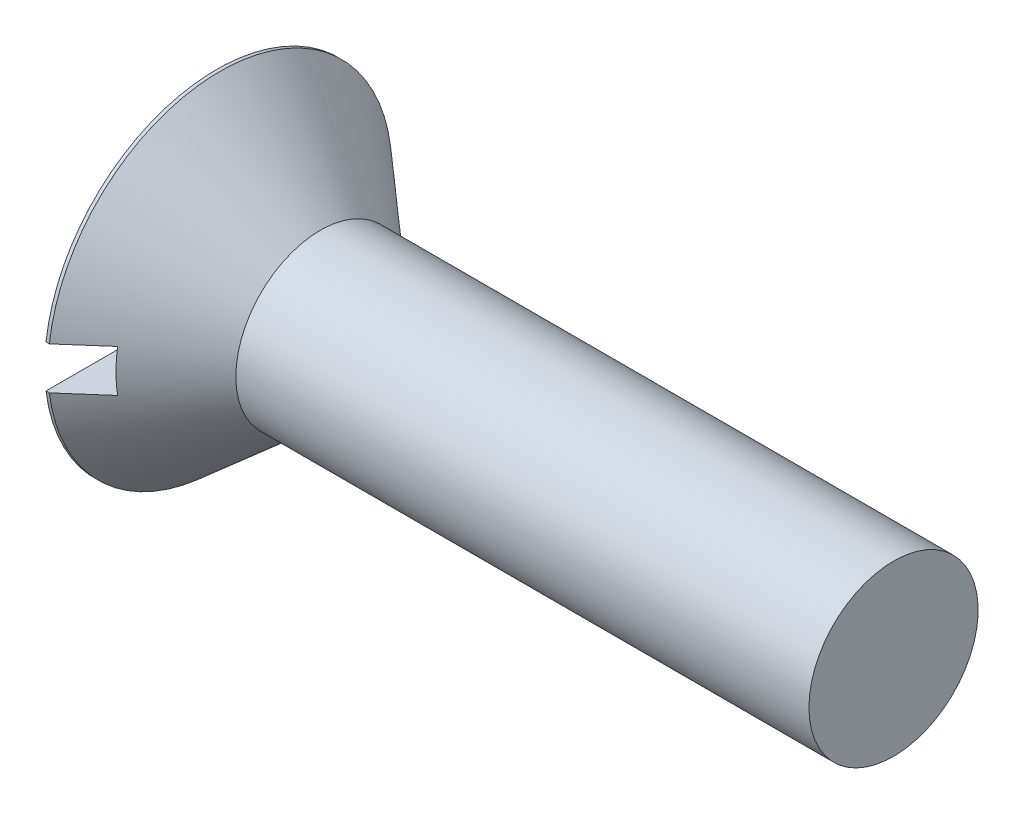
ISO-10303-21;
HEADER;
FILE_DESCRIPTION(('STEP AP214'),'2;1');
FILE_NAME('part.step','',(''),(''),'','','');
FILE_SCHEMA(('AUTOMOTIVE_DESIGN { 1 0 10303 214 1 1 1 1 }'));
ENDSEC;
DATA;
#1=APPLICATION_CONTEXT('core data for automotive mechanical design processes');
#2=APPLICATION_PROTOCOL_DEFINITION('international standard','automotive_design',2000,#1);
#3=PRODUCT_CONTEXT('',#1,'mechanical');
#4=PRODUCT('Part','Part','',(#3));
#5=PRODUCT_RELATED_PRODUCT_CATEGORY('part','',(#4));
#6=PRODUCT_DEFINITION_FORMATION('','',#4);
#7=PRODUCT_DEFINITION_CONTEXT('part definition',#1,'design');
#8=PRODUCT_DEFINITION('design','',#6,#7);
#9=PRODUCT_DEFINITION_SHAPE('','',#8);
#10=(LENGTH_UNIT() NAMED_UNIT(*) SI_UNIT(.MILLI.,.METRE.));
#11=(NAMED_UNIT(*) PLANE_ANGLE_UNIT() SI_UNIT($,.RADIAN.));
#12=(NAMED_UNIT(*) SI_UNIT($,.STERADIAN.) SOLID_ANGLE_UNIT());
#13=UNCERTAINTY_MEASURE_WITH_UNIT(LENGTH_MEASURE(1.E-05),#10,'distance_accuracy_value','');
#14=(GEOMETRIC_REPRESENTATION_CONTEXT(3) GLOBAL_UNCERTAINTY_ASSIGNED_CONTEXT((#13)) GLOBAL_UNIT_ASSIGNED_CONTEXT((#10,
#11,#12)) REPRESENTATION_CONTEXT('',''));
#15=CARTESIAN_POINT('',(0.,0.,0.));
#16=DIRECTION('',(0.,0.,1.));
#17=DIRECTION('',(1.,0.,0.));
#18=AXIS2_PLACEMENT_3D('',#15,#16,#17);
#19=CARTESIAN_POINT('',(2.2352,1.1938,-9.67739999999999));
#20=DIRECTION('',(-1.,0.,0.));
#21=DIRECTION('',(0.,0.,1.));
#22=AXIS2_PLACEMENT_3D('',#19,#20,#21);
#23=PLANE('',#22);
#24=DIRECTION('',(0.,-1.,0.));
#25=VECTOR('',#24,1.);
#26=CARTESIAN_POINT('',(2.2352,1.19379999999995,4.93366687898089));
#27=LINE('',#26,#25);
#28=CARTESIAN_POINT('',(2.2352,0.93915286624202,4.93366687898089));
#29=VERTEX_POINT('',#28);
#30=CARTESIAN_POINT('',(2.2352,-0.939152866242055,4.93366687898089));
#31=VERTEX_POINT('',#30);
#32=EDGE_CURVE('E317',#29,#31,#27,.T.);
#33=ORIENTED_EDGE('',*,*,#32,.T.);
#34=DIRECTION('',(0.,0.,-1.));
#35=VECTOR('',#34,1.);
#36=CARTESIAN_POINT('',(2.2352,-0.939152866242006,-9.6774));
#37=LINE('',#36,#35);
#38=CARTESIAN_POINT('',(2.2352,-0.939152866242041,0.939152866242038));
#39=VERTEX_POINT('',#38);
#40=EDGE_CURVE('E164',#31,#39,#37,.T.);
#41=ORIENTED_EDGE('',*,*,#40,.T.);
#42=DIRECTION('',(0.,-1.,0.));
#43=VECTOR('',#42,1.);
#44=CARTESIAN_POINT('',(2.2352,1.1938,0.939152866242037));
#45=LINE('',#44,#43);
#46=CARTESIAN_POINT('',(2.2352,-1.1938,0.939152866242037));
#47=VERTEX_POINT('',#46);
#48=EDGE_CURVE('E41',#39,#47,#45,.T.);
#49=ORIENTED_EDGE('',*,*,#48,.T.);
#50=DIRECTION('',(0.,0.,1.));
#51=VECTOR('',#50,1.);
#52=CARTESIAN_POINT('',(2.2352,-1.1938,-9.6774));
#53=LINE('',#52,#51);
#54=CARTESIAN_POINT('',(2.2352,-1.1938,7.80709754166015));
#55=VERTEX_POINT('',#54);
#56=EDGE_CURVE('E56',#47,#55,#53,.T.);
#57=ORIENTED_EDGE('',*,*,#56,.T.);
#58=CARTESIAN_POINT('',(2.2352,0.,0.));
#59=DIRECTION('',(-1.,0.,0.));
#60=DIRECTION('',(0.,0.,1.));
#61=AXIS2_PLACEMENT_3D('',#58,#59,#60);
#62=CIRCLE('',#61,7.89784340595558);
#63=CARTESIAN_POINT('',(2.2352,1.1938,7.80709754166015));
#64=VERTEX_POINT('',#63);
#65=EDGE_CURVE('E265',#64,#55,#62,.F.);
#66=ORIENTED_EDGE('',*,*,#65,.F.);
#67=DIRECTION('',(0.,0.,-1.));
#68=VECTOR('',#67,1.);
#69=CARTESIAN_POINT('',(2.2352,1.1938,9.6774));
#70=LINE('',#69,#68);
#71=CARTESIAN_POINT('',(2.2352,1.1938,0.939152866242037));
#72=VERTEX_POINT('',#71);
#73=EDGE_CURVE('E229',#64,#72,#70,.T.);
#74=ORIENTED_EDGE('',*,*,#73,.T.);
#75=CARTESIAN_POINT('',(2.2352,0.939152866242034,0.939152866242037));
#76=VERTEX_POINT('',#75);
#77=EDGE_CURVE('E11',#72,#76,#45,.T.);
#78=ORIENTED_EDGE('',*,*,#77,.T.);
#79=DIRECTION('',(0.,0.,1.));
#80=VECTOR('',#79,1.);
#81=CARTESIAN_POINT('',(2.2352,0.939152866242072,-9.67739999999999));
#82=LINE('',#81,#80);
#83=EDGE_CURVE('E318',#76,#29,#82,.T.);
#84=ORIENTED_EDGE('',*,*,#83,.T.);
#85=EDGE_LOOP('',(#33,#41,#49,#57,#66,#74,#78,#84));
#86=FACE_BOUND('',#85,.T.);
#87=ADVANCED_FACE('F33',(#86),#23,.T.);
#88=DIRECTION('',(0.,1.,0.));
#89=VECTOR('',#88,1.);
#90=CARTESIAN_POINT('',(2.2352,1.1938,-0.939152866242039));
#91=LINE('',#90,#89);
#92=CARTESIAN_POINT('',(2.2352,-1.1938,-0.939152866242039));
#93=VERTEX_POINT('',#92);
#94=CARTESIAN_POINT('',(2.2352,-0.939152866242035,-0.939152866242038));
#95=VERTEX_POINT('',#94);
#96=EDGE_CURVE('E390',#93,#95,#91,.T.);
#97=ORIENTED_EDGE('',*,*,#96,.T.);
#98=DIRECTION('',(0.,0.,-1.));
#99=VECTOR('',#98,1.);
#100=CARTESIAN_POINT('',(2.2352,-0.939152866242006,-9.6774));
#101=LINE('',#100,#99);
#102=CARTESIAN_POINT('',(2.2352,-0.939152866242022,-4.9336668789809));
#103=VERTEX_POINT('',#102);
#104=EDGE_CURVE('E190',#95,#103,#101,.T.);
#105=ORIENTED_EDGE('',*,*,#104,.T.);
#106=DIRECTION('',(0.,1.,0.));
#107=VECTOR('',#106,1.);
#108=CARTESIAN_POINT('',(2.2352,1.19379999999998,-4.93366687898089));
#109=LINE('',#108,#107);
#110=CARTESIAN_POINT('',(2.2352,0.939152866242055,-4.93366687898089));
#111=VERTEX_POINT('',#110);
#112=EDGE_CURVE('E333',#103,#111,#109,.T.);
#113=ORIENTED_EDGE('',*,*,#112,.T.);
#114=DIRECTION('',(0.,0.,1.));
#115=VECTOR('',#114,1.);
#116=CARTESIAN_POINT('',(2.2352,0.939152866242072,-9.67739999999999));
#117=LINE('',#116,#115);
#118=CARTESIAN_POINT('',(2.2352,0.939152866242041,-0.939152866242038));
#119=VERTEX_POINT('',#118);
#120=EDGE_CURVE('E323',#111,#119,#117,.T.);
#121=ORIENTED_EDGE('',*,*,#120,.T.);
#122=CARTESIAN_POINT('',(2.2352,1.1938,-0.939152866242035));
#123=VERTEX_POINT('',#122);
#124=EDGE_CURVE('E48',#119,#123,#91,.T.);
#125=ORIENTED_EDGE('',*,*,#124,.T.);
#126=CARTESIAN_POINT('',(2.2352,1.1938,-7.80709754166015));
#127=VERTEX_POINT('',#126);
#128=EDGE_CURVE('E232',#123,#127,#70,.T.);
#129=ORIENTED_EDGE('',*,*,#128,.T.);
#130=CARTESIAN_POINT('',(2.2352,-1.1938,-7.80709754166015));
#131=VERTEX_POINT('',#130);
#132=EDGE_CURVE('E269',#131,#127,#62,.F.);
#133=ORIENTED_EDGE('',*,*,#132,.F.);
#134=EDGE_CURVE('E233',#131,#93,#53,.T.);
#135=ORIENTED_EDGE('',*,*,#134,.T.);
#136=EDGE_LOOP('',(#97,#105,#113,#121,#125,#129,#133,#135));
#137=FACE_BOUND('',#136,.T.);
#138=ADVANCED_FACE('F312',(#137),#23,.T.);
#139=CARTESIAN_POINT('',(8.69008083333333,0.,0.497178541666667));
#140=DIRECTION('',(-0.0683113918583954,0.,-0.997664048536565));
#141=DIRECTION('',(-0.997664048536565,0.,0.0683113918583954));
#142=AXIS2_PLACEMENT_3D('',#139,#140,#141);
#143=PLANE('',#142);
#144=ORIENTED_EDGE('',*,*,#48,.F.);
#145=DIRECTION('',(0.995344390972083,0.0681525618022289,-0.0681525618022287));
#146=VECTOR('',#145,1.);
#147=CARTESIAN_POINT('',(8.72380707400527,-0.494869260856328,0.494869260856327));
#148=LINE('',#147,#146);
#149=CARTESIAN_POINT('',(7.9756,-0.546100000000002,0.546099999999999));
#150=VERTEX_POINT('',#149);
#151=EDGE_CURVE('E162',#39,#150,#148,.T.);
#152=ORIENTED_EDGE('',*,*,#151,.T.);
#153=DIRECTION('',(0.793328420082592,0.606365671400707,-0.0543202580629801));
#154=VECTOR('',#153,1.);
#155=CARTESIAN_POINT('',(0.,-6.6421,1.0922));
#156=LINE('',#155,#154);
#157=CARTESIAN_POINT('',(0.,-6.6421,1.0922));
#158=VERTEX_POINT('',#157);
#159=EDGE_CURVE('E187',#158,#150,#156,.T.);
#160=ORIENTED_EDGE('',*,*,#159,.F.);
#161=DIRECTION('',(0.,-1.,0.));
#162=VECTOR('',#161,1.);
#163=CARTESIAN_POINT('',(0.,6.6421,1.0922));
#164=LINE('',#163,#162);
#165=CARTESIAN_POINT('',(0.,-1.1938,1.0922));
#166=VERTEX_POINT('',#165);
#167=EDGE_CURVE('E345',#166,#158,#164,.T.);
#168=ORIENTED_EDGE('',*,*,#167,.F.);
#169=DIRECTION('',(0.997664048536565,0.,-0.0683113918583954));
#170=VECTOR('',#169,1.);
#171=CARTESIAN_POINT('',(2.95873739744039,-1.1938,0.889611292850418));
#172=LINE('',#171,#170);
#173=EDGE_CURVE('E224',#166,#47,#172,.T.);
#174=ORIENTED_EDGE('',*,*,#173,.T.);
#175=EDGE_LOOP('',(#144,#152,#160,#168,#174));
#176=FACE_BOUND('',#175,.T.);
#177=ADVANCED_FACE('F185',(#176),#143,.T.);
#178=DIRECTION('',(0.793328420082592,-0.606365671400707,-0.05432025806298));
#179=VECTOR('',#178,1.);
#180=CARTESIAN_POINT('',(0.,6.6421,1.0922));
#181=LINE('',#180,#179);
#182=CARTESIAN_POINT('',(0.,6.6421,1.0922));
#183=VERTEX_POINT('',#182);
#184=CARTESIAN_POINT('',(7.9756,0.546100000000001,0.5461));
#185=VERTEX_POINT('',#184);
#186=EDGE_CURVE('E210',#183,#185,#181,.T.);
#187=ORIENTED_EDGE('',*,*,#186,.T.);
#188=DIRECTION('',(-0.995344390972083,0.0681525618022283,0.0681525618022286));
#189=VECTOR('',#188,1.);
#190=CARTESIAN_POINT('',(8.72380707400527,0.494869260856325,0.494869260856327));
#191=LINE('',#190,#189);
#192=EDGE_CURVE('E329',#185,#76,#191,.T.);
#193=ORIENTED_EDGE('',*,*,#192,.T.);
#194=ORIENTED_EDGE('',*,*,#77,.F.);
#195=DIRECTION('',(-0.997664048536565,0.,0.0683113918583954));
#196=VECTOR('',#195,1.);
#197=CARTESIAN_POINT('',(1.63967255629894,1.1938,0.979929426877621));
#198=LINE('',#197,#196);
#199=CARTESIAN_POINT('',(0.,1.1938,1.0922));
#200=VERTEX_POINT('',#199);
#201=EDGE_CURVE('E226',#72,#200,#198,.T.);
#202=ORIENTED_EDGE('',*,*,#201,.T.);
#203=EDGE_CURVE('E346',#183,#200,#164,.T.);
#204=ORIENTED_EDGE('',*,*,#203,.F.);
#205=EDGE_LOOP('',(#187,#193,#194,#202,#204));
#206=FACE_BOUND('',#205,.T.);
#207=ADVANCED_FACE('F366',(#206),#143,.T.);
#208=CARTESIAN_POINT('',(8.69008083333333,0.,-0.497178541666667));
#209=DIRECTION('',(-0.0683113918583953,0.,0.997664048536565));
#210=DIRECTION('',(0.997664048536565,0.,0.0683113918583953));
#211=AXIS2_PLACEMENT_3D('',#208,#209,#210);
#212=PLANE('',#211);
#213=DIRECTION('',(0.793328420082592,0.606365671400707,0.0543202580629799));
#214=VECTOR('',#213,1.);
#215=CARTESIAN_POINT('',(0.,-6.6421,-1.0922));
#216=LINE('',#215,#214);
#217=CARTESIAN_POINT('',(0.,-6.6421,-1.0922));
#218=VERTEX_POINT('',#217);
#219=CARTESIAN_POINT('',(7.9756,-0.5461,-0.5461));
#220=VERTEX_POINT('',#219);
#221=EDGE_CURVE('E205',#218,#220,#216,.T.);
#222=ORIENTED_EDGE('',*,*,#221,.T.);
#223=DIRECTION('',(-0.995344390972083,-0.0681525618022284,-0.0681525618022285));
#224=VECTOR('',#223,1.);
#225=CARTESIAN_POINT('',(8.72380707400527,-0.494869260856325,-0.494869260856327));
#226=LINE('',#225,#224);
#227=EDGE_CURVE('E336',#220,#95,#226,.T.);
#228=ORIENTED_EDGE('',*,*,#227,.T.);
#229=ORIENTED_EDGE('',*,*,#96,.F.);
#230=DIRECTION('',(-0.997664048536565,0.,-0.0683113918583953));
#231=VECTOR('',#230,1.);
#232=CARTESIAN_POINT('',(1.63967255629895,-1.1938,-0.979929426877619));
#233=LINE('',#232,#231);
#234=CARTESIAN_POINT('',(0.,-1.1938,-1.0922));
#235=VERTEX_POINT('',#234);
#236=EDGE_CURVE('E220',#93,#235,#233,.T.);
#237=ORIENTED_EDGE('',*,*,#236,.T.);
#238=DIRECTION('',(0.,1.,0.));
#239=VECTOR('',#238,1.);
#240=CARTESIAN_POINT('',(0.,-6.6421,-1.0922));
#241=LINE('',#240,#239);
#242=EDGE_CURVE('E208',#218,#235,#241,.T.);
#243=ORIENTED_EDGE('',*,*,#242,.F.);
#244=EDGE_LOOP('',(#222,#228,#229,#237,#243));
#245=FACE_BOUND('',#244,.T.);
#246=ADVANCED_FACE('F389',(#245),#212,.T.);
#247=ORIENTED_EDGE('',*,*,#124,.F.);
#248=DIRECTION('',(0.995344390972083,-0.0681525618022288,0.0681525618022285));
#249=VECTOR('',#248,1.);
#250=CARTESIAN_POINT('',(8.72380707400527,0.494869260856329,-0.494869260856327));
#251=LINE('',#250,#249);
#252=CARTESIAN_POINT('',(7.9756,0.546100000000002,-0.546099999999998));
#253=VERTEX_POINT('',#252);
#254=EDGE_CURVE('E319',#119,#253,#251,.T.);
#255=ORIENTED_EDGE('',*,*,#254,.T.);
#256=DIRECTION('',(0.793328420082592,-0.606365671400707,0.0543202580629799));
#257=VECTOR('',#256,1.);
#258=CARTESIAN_POINT('',(0.,6.6421,-1.0922));
#259=LINE('',#258,#257);
#260=CARTESIAN_POINT('',(0.,6.6421,-1.0922));
#261=VERTEX_POINT('',#260);
#262=EDGE_CURVE('E199',#261,#253,#259,.T.);
#263=ORIENTED_EDGE('',*,*,#262,.F.);
#264=CARTESIAN_POINT('',(0.,1.1938,-1.0922));
#265=VERTEX_POINT('',#264);
#266=EDGE_CURVE('E204',#265,#261,#241,.T.);
#267=ORIENTED_EDGE('',*,*,#266,.F.);
#268=DIRECTION('',(0.997664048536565,0.,0.0683113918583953));
#269=VECTOR('',#268,1.);
#270=CARTESIAN_POINT('',(2.95873739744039,1.1938,-0.88961129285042));
#271=LINE('',#270,#269);
#272=EDGE_CURVE('E222',#265,#123,#271,.T.);
#273=ORIENTED_EDGE('',*,*,#272,.T.);
#274=EDGE_LOOP('',(#247,#255,#263,#267,#273));
#275=FACE_BOUND('',#274,.T.);
#276=ADVANCED_FACE('F376',(#275),#212,.T.);
#277=CARTESIAN_POINT('',(0.,0.,0.));
#278=DIRECTION('',(-1.,0.,0.));
#279=DIRECTION('',(0.,0.,1.));
#280=AXIS2_PLACEMENT_3D('',#277,#278,#279);
#281=PLANE('',#280);
#282=DIRECTION('',(0.,0.,1.));
#283=VECTOR('',#282,1.);
#284=CARTESIAN_POINT('',(0.,6.6421,-1.0922));
#285=LINE('',#284,#283);
#286=EDGE_CURVE('E342',#261,#183,#285,.T.);
#287=ORIENTED_EDGE('',*,*,#286,.T.);
#288=ORIENTED_EDGE('',*,*,#203,.T.);
#289=DIRECTION('',(0.,0.,-1.));
#290=VECTOR('',#289,1.);
#291=CARTESIAN_POINT('',(0.,1.1938,9.6774));
#292=LINE('',#291,#290);
#293=CARTESIAN_POINT('',(0.,1.1938,9.60348438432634));
#294=VERTEX_POINT('',#293);
#295=EDGE_CURVE('E237',#294,#200,#292,.T.);
#296=ORIENTED_EDGE('',*,*,#295,.F.);
#297=CARTESIAN_POINT('',(0.,0.,0.));
#298=DIRECTION('',(-1.,0.,0.));
#299=DIRECTION('',(0.,0.,1.));
#300=AXIS2_PLACEMENT_3D('',#297,#298,#299);
#301=CIRCLE('',#300,9.6774);
#302=CARTESIAN_POINT('',(0.,1.1938,-9.60348438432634));
#303=VERTEX_POINT('',#302);
#304=EDGE_CURVE('E264',#294,#303,#301,.T.);
#305=ORIENTED_EDGE('',*,*,#304,.T.);
#306=EDGE_CURVE('E228',#265,#303,#292,.T.);
#307=ORIENTED_EDGE('',*,*,#306,.F.);
#308=ORIENTED_EDGE('',*,*,#266,.T.);
#309=EDGE_LOOP('',(#287,#288,#296,#305,#307,#308));
#310=FACE_BOUND('',#309,.T.);
#311=ADVANCED_FACE('F35',(#310),#281,.T.);
#312=DIRECTION('',(0.,0.,1.));
#313=VECTOR('',#312,1.);
#314=CARTESIAN_POINT('',(0.,-1.1938,-9.6774));
#315=LINE('',#314,#313);
#316=CARTESIAN_POINT('',(0.,-1.1938,9.60348438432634));
#317=VERTEX_POINT('',#316);
#318=EDGE_CURVE('E240',#166,#317,#315,.T.);
#319=ORIENTED_EDGE('',*,*,#318,.F.);
#320=ORIENTED_EDGE('',*,*,#167,.T.);
#321=DIRECTION('',(0.,0.,-1.));
#322=VECTOR('',#321,1.);
#323=CARTESIAN_POINT('',(0.,-6.6421,1.0922));
#324=LINE('',#323,#322);
#325=EDGE_CURVE('E203',#158,#218,#324,.T.);
#326=ORIENTED_EDGE('',*,*,#325,.T.);
#327=ORIENTED_EDGE('',*,*,#242,.T.);
#328=CARTESIAN_POINT('',(0.,-1.1938,-9.60348438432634));
#329=VERTEX_POINT('',#328);
#330=EDGE_CURVE('E241',#329,#235,#315,.T.);
#331=ORIENTED_EDGE('',*,*,#330,.F.);
#332=EDGE_CURVE('E261',#329,#317,#301,.T.);
#333=ORIENTED_EDGE('',*,*,#332,.T.);
#334=EDGE_LOOP('',(#319,#320,#326,#327,#331,#333));
#335=FACE_BOUND('',#334,.T.);
#336=ADVANCED_FACE('F297',(#335),#281,.T.);
#337=CARTESIAN_POINT('',(2.2352,1.1938,9.6774));
#338=DIRECTION('',(0.,1.,0.));
#339=DIRECTION('',(0.,0.,1.));
#340=AXIS2_PLACEMENT_3D('',#337,#338,#339);
#341=PLANE('',#340);
#342=ORIENTED_EDGE('',*,*,#201,.F.);
#343=ORIENTED_EDGE('',*,*,#73,.F.);
#344=CARTESIAN_POINT('',(-11.4898026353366,1.1938,-19.7928369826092));
#345=CARTESIAN_POINT('',(-10.7282739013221,1.1938,-19.1296381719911));
#346=CARTESIAN_POINT('',(-9.96679664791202,1.1938,-18.4663802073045));
#347=CARTESIAN_POINT('',(-8.44400448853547,1.1938,-17.1396696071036));
#348=CARTESIAN_POINT('',(-7.68268958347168,1.1938,-16.4762169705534));
#349=CARTESIAN_POINT('',(-6.16009107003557,1.1938,-15.1488746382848));
#350=CARTESIAN_POINT('',(-5.3988075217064,1.1938,-14.4849848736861));
#351=CARTESIAN_POINT('',(-3.87658787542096,1.1938,-13.156815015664));
#352=CARTESIAN_POINT('',(-3.11565177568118,1.1938,-12.4925349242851));
#353=CARTESIAN_POINT('',(-1.61266837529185,1.1938,-11.1793728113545));
#354=CARTESIAN_POINT('',(-0.870608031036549,1.1938,-10.5305057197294));
#355=CARTESIAN_POINT('',(0.612654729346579,1.1938,-9.23176820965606));
#356=CARTESIAN_POINT('',(1.35385713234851,1.1938,-8.5818977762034));
#357=CARTESIAN_POINT('',(2.46431349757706,1.1938,-7.6057063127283));
#358=CARTESIAN_POINT('',(2.83420463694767,1.1938,-7.28011039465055));
#359=CARTESIAN_POINT('',(3.5733462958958,1.1938,-6.62818839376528));
#360=CARTESIAN_POINT('',(3.9425968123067,1.1938,-6.30186230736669));
#361=CARTESIAN_POINT('',(4.68009898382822,1.1938,-5.64810195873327));
#362=CARTESIAN_POINT('',(5.04835066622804,1.1938,-5.32066772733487));
#363=CARTESIAN_POINT('',(5.59944958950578,1.1938,-4.82808839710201));
#364=CARTESIAN_POINT('',(5.78293538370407,1.1938,-4.66365796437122));
#365=CARTESIAN_POINT('',(6.14932062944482,1.1938,-4.334145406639));
#366=CARTESIAN_POINT('',(6.33222008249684,1.1938,-4.16906328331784));
#367=CARTESIAN_POINT('',(6.61085838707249,1.1938,-3.91630624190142));
#368=CARTESIAN_POINT('',(6.7068950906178,1.1938,-3.82895981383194));
#369=CARTESIAN_POINT('',(6.89868546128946,1.1938,-3.65395652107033));
#370=CARTESIAN_POINT('',(6.99443912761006,1.1938,-3.56629965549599));
#371=CARTESIAN_POINT('',(7.28123634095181,1.1938,-3.30272759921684));
#372=CARTESIAN_POINT('',(7.47176893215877,1.1938,-3.12625362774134));
#373=CARTESIAN_POINT('',(7.75652836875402,1.1938,-2.85918720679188));
#374=CARTESIAN_POINT('',(7.85158225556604,1.1938,-2.76947695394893));
#375=CARTESIAN_POINT('',(8.04094270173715,1.1938,-2.58927165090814));
#376=CARTESIAN_POINT('',(8.13524926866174,1.1938,-2.4987766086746));
#377=CARTESIAN_POINT('',(8.32280199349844,1.1938,-2.31680042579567));
#378=CARTESIAN_POINT('',(8.41604873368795,1.1938,-2.22531988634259));
#379=CARTESIAN_POINT('',(8.60113460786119,1.1938,-2.04094854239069));
#380=CARTESIAN_POINT('',(8.6929738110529,1.1938,-1.94805780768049));
#381=CARTESIAN_POINT('',(8.87422797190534,1.1938,-1.76066399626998));
#382=CARTESIAN_POINT('',(8.96365125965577,1.1938,-1.66616899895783));
#383=CARTESIAN_POINT('',(9.13952454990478,1.1938,-1.47414431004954));
#384=CARTESIAN_POINT('',(9.22596985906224,1.1938,-1.37661025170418));
#385=CARTESIAN_POINT('',(9.35151816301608,1.1938,-1.22717825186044));
#386=CARTESIAN_POINT('',(9.39260236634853,1.1938,-1.17695004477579));
#387=CARTESIAN_POINT('',(9.47299969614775,1.1938,-1.07510106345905));
#388=CARTESIAN_POINT('',(9.5123131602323,1.1938,-1.02348055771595));
#389=CARTESIAN_POINT('',(9.58844644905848,1.1938,-0.918595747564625));
#390=CARTESIAN_POINT('',(9.62527166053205,1.1938,-0.865335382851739));
#391=CARTESIAN_POINT('',(9.69553557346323,1.1938,-0.756643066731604));
#392=CARTESIAN_POINT('',(9.72897683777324,1.1938,-0.70121280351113));
#393=CARTESIAN_POINT('',(9.78229490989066,1.1938,-0.60363465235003));
#394=CARTESIAN_POINT('',(9.80334267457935,1.1938,-0.562131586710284));
#395=CARTESIAN_POINT('',(9.84217202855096,1.1938,-0.477589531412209));
#396=CARTESIAN_POINT('',(9.85995294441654,1.1938,-0.434550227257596));
#397=CARTESIAN_POINT('',(9.89116809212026,1.1938,-0.347314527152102));
#398=CARTESIAN_POINT('',(9.90463847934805,1.1938,-0.303131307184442));
#399=CARTESIAN_POINT('',(9.92643385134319,1.1938,-0.213513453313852));
#400=CARTESIAN_POINT('',(9.93476333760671,1.1938,-0.168079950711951));
#401=CARTESIAN_POINT('',(9.94391422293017,1.1938,-0.0900477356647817));
#402=CARTESIAN_POINT('',(9.94622642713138,1.1938,-0.0576208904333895));
#403=CARTESIAN_POINT('',(9.94780330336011,1.1938,0.00730866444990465));
#404=CARTESIAN_POINT('',(9.94706765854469,1.1938,0.0398113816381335));
#405=CARTESIAN_POINT('',(9.94028733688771,1.1938,0.137101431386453));
#406=CARTESIAN_POINT('',(9.92966101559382,1.1938,0.201600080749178));
#407=CARTESIAN_POINT('',(9.89262661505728,1.1938,0.350494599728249));
#408=CARTESIAN_POINT('',(9.86193906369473,1.1938,0.433774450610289));
#409=CARTESIAN_POINT('',(9.80699388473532,1.1938,0.554532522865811));
#410=CARTESIAN_POINT('',(9.78712669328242,1.1938,0.594194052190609));
#411=CARTESIAN_POINT('',(9.74504611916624,1.1938,0.672252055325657));
#412=CARTESIAN_POINT('',(9.72283341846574,1.1938,0.71064889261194));
#413=CARTESIAN_POINT('',(9.65802013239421,1.1938,0.816731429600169));
#414=CARTESIAN_POINT('',(9.61337970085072,1.1938,0.883159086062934));
#415=CARTESIAN_POINT('',(9.52026331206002,1.1938,1.01329132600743));
#416=CARTESIAN_POINT('',(9.47178430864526,1.1938,1.07699368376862));
#417=CARTESIAN_POINT('',(9.37210823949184,1.1938,1.20247328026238));
#418=CARTESIAN_POINT('',(9.32090484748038,1.1938,1.2642454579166));
#419=CARTESIAN_POINT('',(9.21665334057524,1.1938,1.38621561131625));
#420=CARTESIAN_POINT('',(9.16360498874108,1.1938,1.4464133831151));
#421=CARTESIAN_POINT('',(9.05587122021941,1.1938,1.56591847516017));
#422=CARTESIAN_POINT('',(9.00117844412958,1.1938,1.62521913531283));
#423=CARTESIAN_POINT('',(8.89076932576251,1.1938,1.74286468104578));
#424=CARTESIAN_POINT('',(8.83505291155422,1.1938,1.80120949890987));
#425=CARTESIAN_POINT('',(8.7229308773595,1.1938,1.91703874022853));
#426=CARTESIAN_POINT('',(8.66652659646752,1.1938,1.9745244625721));
#427=CARTESIAN_POINT('',(8.55310321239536,1.1938,2.08888148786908));
#428=CARTESIAN_POINT('',(8.49608412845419,1.1938,2.14575280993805));
#429=CARTESIAN_POINT('',(8.32594080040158,1.1938,2.31399298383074));
#430=CARTESIAN_POINT('',(8.21210974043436,1.1938,2.42464668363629));
#431=CARTESIAN_POINT('',(7.98316902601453,1.1938,2.64462506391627));
#432=CARTESIAN_POINT('',(7.86805933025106,1.1938,2.75394970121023));
#433=CARTESIAN_POINT('',(7.63692082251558,1.1938,2.97164536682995));
#434=CARTESIAN_POINT('',(7.52089191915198,1.1938,3.08001629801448));
#435=CARTESIAN_POINT('',(7.28816546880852,1.1938,3.29603831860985));
#436=CARTESIAN_POINT('',(7.17146791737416,1.1938,3.40368940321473));
#437=CARTESIAN_POINT('',(6.82042061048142,1.1938,3.72601676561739));
#438=CARTESIAN_POINT('',(6.58532082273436,1.1938,3.93987573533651));
#439=CARTESIAN_POINT('',(6.11392315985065,1.1938,4.36623728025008));
#440=CARTESIAN_POINT('',(5.87762535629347,1.1938,4.57873993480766));
#441=CARTESIAN_POINT('',(5.40574548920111,1.1938,5.00148246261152));
#442=CARTESIAN_POINT('',(5.17016858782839,1.1938,5.21172810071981));
#443=CARTESIAN_POINT('',(4.69845742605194,1.1938,5.63159996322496));
#444=CARTESIAN_POINT('',(4.46232315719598,1.1938,5.84122617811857));
#445=CARTESIAN_POINT('',(3.75350149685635,1.1938,6.46928311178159));
#446=CARTESIAN_POINT('',(3.28022270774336,1.1938,6.88704616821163));
#447=CARTESIAN_POINT('',(2.21621828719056,1.1938,7.82423394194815));
#448=CARTESIAN_POINT('',(1.6252479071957,1.1938,8.34338046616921));
#449=CARTESIAN_POINT('',(0.442525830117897,1.1938,9.38078521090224));
#450=CARTESIAN_POINT('',(-0.14922586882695,1.1938,9.89904342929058));
#451=CARTESIAN_POINT('',(-1.33330631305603,1.1938,10.9350846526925));
#452=CARTESIAN_POINT('',(-1.92563513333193,1.1938,11.4528675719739));
#453=CARTESIAN_POINT('',(-3.1106160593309,1.1938,12.4880633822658));
#454=CARTESIAN_POINT('',(-3.70326816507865,1.1938,13.0054762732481));
#455=CARTESIAN_POINT('',(-5.49445193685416,1.1938,14.5685909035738));
#456=CARTESIAN_POINT('',(-6.69332378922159,1.1938,15.6139027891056));
#457=CARTESIAN_POINT('',(-8.49189186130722,1.1938,17.1813761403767));
#458=CARTESIAN_POINT('',(-9.09140946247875,1.1938,17.7037426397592));
#459=CARTESIAN_POINT('',(-10.2905401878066,1.1938,18.7483656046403));
#460=CARTESIAN_POINT('',(-10.8901533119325,1.1938,19.2706220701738));
#461=CARTESIAN_POINT('',(-11.4898026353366,1.1938,19.7928369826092));
#462=B_SPLINE_CURVE_WITH_KNOTS('',3,(#344,#345,#346,#347,#348,#349,#350,#351,#352,#353,#354,
#355,#356,#357,#358,#359,#360,#361,#362,#363,#364,#365,#366,#367,#368,#369,#370,#371,#372,#373,
#374,#375,#376,#377,#378,#379,#380,#381,#382,#383,#384,#385,#386,#387,#388,#389,#390,#391,#392,
#393,#394,#395,#396,#397,#398,#399,#400,#401,#402,#403,#404,#405,#406,#407,#408,#409,#410,#411,
#412,#413,#414,#415,#416,#417,#418,#419,#420,#421,#422,#423,#424,#425,#426,#427,#428,#429,#430,
#431,#432,#433,#434,#435,#436,#437,#438,#439,#440,#441,#442,#443,#444,#445,#446,#447,#448,#449,
#450,#451,#452,#453,#454,#455,#456,#457,#458,#459,#460,#461),.UNSPECIFIED.,.F.,.F.,(4,2,2,2,2,2,
2,2,2,2,2,2,2,2,2,2,2,2,2,2,2,2,2,2,2,2,2,2,2,2,2,2,2,2,2,2,2,2,2,2,2,2,2,2,2,2,2,2,2,2,2,2,2,2,
2,2,2,2,4),(0.,3.02949307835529,6.05900258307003,9.08930288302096,12.1195874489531,
15.0768051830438,18.0340675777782,19.512406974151,20.9907536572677,22.4690595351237,
23.2082064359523,23.9473514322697,24.3368016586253,24.7262529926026,25.5053464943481,
25.8974512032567,26.2895519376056,26.6814256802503,27.0732800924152,27.4635432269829,
27.8543956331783,28.0490394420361,28.2436459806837,28.4378167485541,28.6318393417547,
28.7713378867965,28.9108651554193,29.049189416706,29.1873923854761,29.2847831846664,
29.3821841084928,29.5771956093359,29.8418190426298,29.9748586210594,30.1078596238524,
30.3477358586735,30.5878043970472,30.8284570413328,31.0691407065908,31.3111390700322,
31.5531545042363,31.7947567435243,32.0363514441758,32.5125848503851,32.9888336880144,
33.4651304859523,33.9414304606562,34.894870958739,35.8482551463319,36.7955112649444,
37.7427818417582,39.6366290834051,41.9964650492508,44.3563066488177,46.7165126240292,
49.0767187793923,53.8484828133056,56.2339792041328,58.619474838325),.UNSPECIFIED.);
#463=CARTESIAN_POINT('',(0.188054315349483,1.1938,9.60348438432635));
#464=VERTEX_POINT('',#463);
#465=EDGE_CURVE('E276',#64,#464,#462,.T.);
#466=ORIENTED_EDGE('',*,*,#465,.T.);
#467=DIRECTION('',(-1.,0.,0.));
#468=VECTOR('',#467,1.);
#469=CARTESIAN_POINT('',(-6.34999999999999,1.1938,9.60348438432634));
#470=LINE('',#469,#468);
#471=EDGE_CURVE('E247',#464,#294,#470,.T.);
#472=ORIENTED_EDGE('',*,*,#471,.T.);
#473=ORIENTED_EDGE('',*,*,#295,.T.);
#474=EDGE_LOOP('',(#342,#343,#466,#472,#473));
#475=FACE_BOUND('',#474,.T.);
#476=ADVANCED_FACE('F293',(#475),#341,.F.);
#477=ORIENTED_EDGE('',*,*,#272,.F.);
#478=ORIENTED_EDGE('',*,*,#306,.T.);
#479=DIRECTION('',(-1.,0.,0.));
#480=VECTOR('',#479,1.);
#481=CARTESIAN_POINT('',(-6.34999999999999,1.1938,-9.60348438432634));
#482=LINE('',#481,#480);
#483=CARTESIAN_POINT('',(0.188054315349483,1.1938,-9.60348438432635));
#484=VERTEX_POINT('',#483);
#485=EDGE_CURVE('E249',#303,#484,#482,.F.);
#486=ORIENTED_EDGE('',*,*,#485,.T.);
#487=EDGE_CURVE('E393',#484,#127,#462,.T.);
#488=ORIENTED_EDGE('',*,*,#487,.T.);
#489=ORIENTED_EDGE('',*,*,#128,.F.);
#490=EDGE_LOOP('',(#477,#478,#486,#488,#489));
#491=FACE_BOUND('',#490,.T.);
#492=ADVANCED_FACE('F290',(#491),#341,.F.);
#493=CARTESIAN_POINT('',(2.2352,-1.1938,-9.6774));
#494=DIRECTION('',(0.,-1.,0.));
#495=DIRECTION('',(0.,0.,-1.));
#496=AXIS2_PLACEMENT_3D('',#493,#494,#495);
#497=PLANE('',#496);
#498=ORIENTED_EDGE('',*,*,#173,.F.);
#499=ORIENTED_EDGE('',*,*,#318,.T.);
#500=DIRECTION('',(-1.,0.,0.));
#501=VECTOR('',#500,1.);
#502=CARTESIAN_POINT('',(-6.34999999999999,-1.1938,9.60348438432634));
#503=LINE('',#502,#501);
#504=CARTESIAN_POINT('',(0.188054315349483,-1.1938,9.60348438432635));
#505=VERTEX_POINT('',#504);
#506=EDGE_CURVE('E245',#317,#505,#503,.F.);
#507=ORIENTED_EDGE('',*,*,#506,.T.);
#508=CARTESIAN_POINT('',(-11.4898026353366,-1.1938,19.7928369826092));
#509=CARTESIAN_POINT('',(-10.7282739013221,-1.1938,19.1296381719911));
#510=CARTESIAN_POINT('',(-9.96679664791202,-1.1938,18.4663802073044));
#511=CARTESIAN_POINT('',(-8.44400448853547,-1.1938,17.1396696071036));
#512=CARTESIAN_POINT('',(-7.68268958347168,-1.1938,16.4762169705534));
#513=CARTESIAN_POINT('',(-6.16009107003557,-1.1938,15.1488746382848));
#514=CARTESIAN_POINT('',(-5.3988075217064,-1.1938,14.4849848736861));
#515=CARTESIAN_POINT('',(-3.87658787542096,-1.1938,13.156815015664));
#516=CARTESIAN_POINT('',(-3.11565177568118,-1.1938,12.4925349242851));
#517=CARTESIAN_POINT('',(-1.61266837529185,-1.1938,11.1793728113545));
#518=CARTESIAN_POINT('',(-0.870608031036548,-1.1938,10.5305057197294));
#519=CARTESIAN_POINT('',(0.612654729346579,-1.1938,9.23176820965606));
#520=CARTESIAN_POINT('',(1.35385713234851,-1.1938,8.58189777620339));
#521=CARTESIAN_POINT('',(2.46431349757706,-1.1938,7.6057063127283));
#522=CARTESIAN_POINT('',(2.83420463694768,-1.1938,7.28011039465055));
#523=CARTESIAN_POINT('',(3.5733462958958,-1.1938,6.62818839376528));
#524=CARTESIAN_POINT('',(3.9425968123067,-1.1938,6.30186230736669));
#525=CARTESIAN_POINT('',(4.68009898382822,-1.1938,5.64810195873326));
#526=CARTESIAN_POINT('',(5.04835066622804,-1.1938,5.32066772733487));
#527=CARTESIAN_POINT('',(5.59944958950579,-1.1938,4.82808839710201));
#528=CARTESIAN_POINT('',(5.78293538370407,-1.1938,4.66365796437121));
#529=CARTESIAN_POINT('',(6.14932062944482,-1.1938,4.33414540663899));
#530=CARTESIAN_POINT('',(6.33222008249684,-1.1938,4.16906328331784));
#531=CARTESIAN_POINT('',(6.61085838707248,-1.1938,3.91630624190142));
#532=CARTESIAN_POINT('',(6.70689509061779,-1.1938,3.82895981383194));
#533=CARTESIAN_POINT('',(6.89868546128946,-1.1938,3.65395652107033));
#534=CARTESIAN_POINT('',(6.99443912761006,-1.1938,3.56629965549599));
#535=CARTESIAN_POINT('',(7.28123634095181,-1.1938,3.30272759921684));
#536=CARTESIAN_POINT('',(7.47176893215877,-1.1938,3.12625362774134));
#537=CARTESIAN_POINT('',(7.75652836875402,-1.1938,2.85918720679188));
#538=CARTESIAN_POINT('',(7.85158225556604,-1.1938,2.76947695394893));
#539=CARTESIAN_POINT('',(8.04094270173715,-1.1938,2.58927165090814));
#540=CARTESIAN_POINT('',(8.13524926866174,-1.1938,2.4987766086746));
#541=CARTESIAN_POINT('',(8.32280199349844,-1.1938,2.31680042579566));
#542=CARTESIAN_POINT('',(8.41604873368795,-1.1938,2.22531988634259));
#543=CARTESIAN_POINT('',(8.60113460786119,-1.1938,2.04094854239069));
#544=CARTESIAN_POINT('',(8.6929738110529,-1.1938,1.94805780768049));
#545=CARTESIAN_POINT('',(8.87422797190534,-1.1938,1.76066399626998));
#546=CARTESIAN_POINT('',(8.96365125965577,-1.1938,1.66616899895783));
#547=CARTESIAN_POINT('',(9.13952454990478,-1.1938,1.47414431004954));
#548=CARTESIAN_POINT('',(9.22596985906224,-1.1938,1.37661025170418));
#549=CARTESIAN_POINT('',(9.35151816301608,-1.1938,1.22717825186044));
#550=CARTESIAN_POINT('',(9.39260236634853,-1.1938,1.17695004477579));
#551=CARTESIAN_POINT('',(9.47299969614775,-1.1938,1.07510106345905));
#552=CARTESIAN_POINT('',(9.5123131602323,-1.1938,1.02348055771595));
#553=CARTESIAN_POINT('',(9.58844644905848,-1.1938,0.918595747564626));
#554=CARTESIAN_POINT('',(9.62527166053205,-1.1938,0.865335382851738));
#555=CARTESIAN_POINT('',(9.69553557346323,-1.1938,0.756643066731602));
#556=CARTESIAN_POINT('',(9.72897683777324,-1.1938,0.701212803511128));
#557=CARTESIAN_POINT('',(9.78229490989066,-1.1938,0.60363465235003));
#558=CARTESIAN_POINT('',(9.80334267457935,-1.1938,0.562131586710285));
#559=CARTESIAN_POINT('',(9.84217202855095,-1.1938,0.477589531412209));
#560=CARTESIAN_POINT('',(9.85995294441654,-1.1938,0.434550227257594));
#561=CARTESIAN_POINT('',(9.89116809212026,-1.1938,0.3473145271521));
#562=CARTESIAN_POINT('',(9.90463847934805,-1.1938,0.303131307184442));
#563=CARTESIAN_POINT('',(9.92643385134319,-1.1938,0.213513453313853));
#564=CARTESIAN_POINT('',(9.93476333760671,-1.1938,0.168079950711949));
#565=CARTESIAN_POINT('',(9.94391422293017,-1.1938,0.0900477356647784));
#566=CARTESIAN_POINT('',(9.94622642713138,-1.1938,0.0576208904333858));
#567=CARTESIAN_POINT('',(9.94780330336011,-1.1938,-0.00730866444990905));
#568=CARTESIAN_POINT('',(9.94706765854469,-1.1938,-0.0398113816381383));
#569=CARTESIAN_POINT('',(9.94028733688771,-1.1938,-0.137101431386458));
#570=CARTESIAN_POINT('',(9.92966101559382,-1.1938,-0.201600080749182));
#571=CARTESIAN_POINT('',(9.89262661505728,-1.1938,-0.350494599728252));
#572=CARTESIAN_POINT('',(9.86193906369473,-1.1938,-0.433774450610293));
#573=CARTESIAN_POINT('',(9.80699388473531,-1.1938,-0.554532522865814));
#574=CARTESIAN_POINT('',(9.78712669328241,-1.1938,-0.594194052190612));
#575=CARTESIAN_POINT('',(9.74504611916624,-1.1938,-0.672252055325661));
#576=CARTESIAN_POINT('',(9.72283341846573,-1.1938,-0.710648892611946));
#577=CARTESIAN_POINT('',(9.65802013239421,-1.1938,-0.816731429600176));
#578=CARTESIAN_POINT('',(9.61337970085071,-1.1938,-0.883159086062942));
#579=CARTESIAN_POINT('',(9.52026331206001,-1.1938,-1.01329132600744));
#580=CARTESIAN_POINT('',(9.47178430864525,-1.1938,-1.07699368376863));
#581=CARTESIAN_POINT('',(9.37210823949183,-1.1938,-1.20247328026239));
#582=CARTESIAN_POINT('',(9.32090484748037,-1.1938,-1.26424545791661));
#583=CARTESIAN_POINT('',(9.21665334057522,-1.1938,-1.38621561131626));
#584=CARTESIAN_POINT('',(9.16360498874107,-1.1938,-1.44641338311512));
#585=CARTESIAN_POINT('',(9.05587122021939,-1.1938,-1.56591847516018));
#586=CARTESIAN_POINT('',(9.00117844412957,-1.1938,-1.62521913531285));
#587=CARTESIAN_POINT('',(8.8907693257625,-1.1938,-1.7428646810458));
#588=CARTESIAN_POINT('',(8.83505291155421,-1.1938,-1.80120949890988));
#589=CARTESIAN_POINT('',(8.72293087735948,-1.1938,-1.91703874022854));
#590=CARTESIAN_POINT('',(8.6665265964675,-1.1938,-1.97452446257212));
#591=CARTESIAN_POINT('',(8.55310321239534,-1.1938,-2.0888814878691));
#592=CARTESIAN_POINT('',(8.49608412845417,-1.1938,-2.14575280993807));
#593=CARTESIAN_POINT('',(8.32594080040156,-1.1938,-2.31399298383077));
#594=CARTESIAN_POINT('',(8.21210974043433,-1.1938,-2.42464668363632));
#595=CARTESIAN_POINT('',(7.98316902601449,-1.1938,-2.6446250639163));
#596=CARTESIAN_POINT('',(7.86805933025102,-1.1938,-2.75394970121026));
#597=CARTESIAN_POINT('',(7.63692082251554,-1.1938,-2.97164536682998));
#598=CARTESIAN_POINT('',(7.52089191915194,-1.1938,-3.08001629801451));
#599=CARTESIAN_POINT('',(7.28816546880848,-1.1938,-3.29603831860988));
#600=CARTESIAN_POINT('',(7.17146791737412,-1.1938,-3.40368940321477));
#601=CARTESIAN_POINT('',(6.82042061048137,-1.1938,-3.72601676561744));
#602=CARTESIAN_POINT('',(6.58532082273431,-1.1938,-3.93987573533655));
#603=CARTESIAN_POINT('',(6.11392315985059,-1.1938,-4.36623728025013));
#604=CARTESIAN_POINT('',(5.87762535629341,-1.1938,-4.57873993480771));
#605=CARTESIAN_POINT('',(5.40574548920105,-1.1938,-5.00148246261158));
#606=CARTESIAN_POINT('',(5.17016858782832,-1.1938,-5.21172810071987));
#607=CARTESIAN_POINT('',(4.69845742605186,-1.1938,-5.63159996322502));
#608=CARTESIAN_POINT('',(4.4623231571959,-1.1938,-5.84122617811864));
#609=CARTESIAN_POINT('',(3.75350149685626,-1.1938,-6.46928311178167));
#610=CARTESIAN_POINT('',(3.28022270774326,-1.1938,-6.88704616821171));
#611=CARTESIAN_POINT('',(2.21621828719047,-1.1938,-7.82423394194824));
#612=CARTESIAN_POINT('',(1.62524790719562,-1.1938,-8.34338046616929));
#613=CARTESIAN_POINT('',(0.442525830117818,-1.1938,-9.38078521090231));
#614=CARTESIAN_POINT('',(-0.149225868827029,-1.1938,-9.89904342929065));
#615=CARTESIAN_POINT('',(-1.33330631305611,-1.1938,-10.9350846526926));
#616=CARTESIAN_POINT('',(-1.925635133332,-1.1938,-11.452867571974));
#617=CARTESIAN_POINT('',(-3.11061605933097,-1.1938,-12.4880633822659));
#618=CARTESIAN_POINT('',(-3.70326816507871,-1.1938,-13.0054762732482));
#619=CARTESIAN_POINT('',(-5.49445193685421,-1.1938,-14.5685909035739));
#620=CARTESIAN_POINT('',(-6.69332378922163,-1.1938,-15.6139027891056));
#621=CARTESIAN_POINT('',(-8.49189186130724,-1.1938,-17.1813761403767));
#622=CARTESIAN_POINT('',(-9.09140946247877,-1.1938,-17.7037426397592));
#623=CARTESIAN_POINT('',(-10.2905401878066,-1.1938,-18.7483656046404));
#624=CARTESIAN_POINT('',(-10.8901533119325,-1.1938,-19.2706220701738));
#625=CARTESIAN_POINT('',(-11.4898026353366,-1.1938,-19.7928369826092));
#626=B_SPLINE_CURVE_WITH_KNOTS('',3,(#508,#509,#510,#511,#512,#513,#514,#515,#516,#517,#518,
#519,#520,#521,#522,#523,#524,#525,#526,#527,#528,#529,#530,#531,#532,#533,#534,#535,#536,#537,
#538,#539,#540,#541,#542,#543,#544,#545,#546,#547,#548,#549,#550,#551,#552,#553,#554,#555,#556,
#557,#558,#559,#560,#561,#562,#563,#564,#565,#566,#567,#568,#569,#570,#571,#572,#573,#574,#575,
#576,#577,#578,#579,#580,#581,#582,#583,#584,#585,#586,#587,#588,#589,#590,#591,#592,#593,#594,
#595,#596,#597,#598,#599,#600,#601,#602,#603,#604,#605,#606,#607,#608,#609,#610,#611,#612,#613,
#614,#615,#616,#617,#618,#619,#620,#621,#622,#623,#624,#625),.UNSPECIFIED.,.F.,.F.,(4,2,2,2,2,2,
2,2,2,2,2,2,2,2,2,2,2,2,2,2,2,2,2,2,2,2,2,2,2,2,2,2,2,2,2,2,2,2,2,2,2,2,2,2,2,2,2,2,2,2,2,2,2,2,
2,2,2,2,4),(0.,3.0294930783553,6.05900258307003,9.08930288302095,12.1195874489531,
15.0768051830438,18.0340675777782,19.512406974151,20.9907536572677,22.4690595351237,
23.2082064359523,23.9473514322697,24.3368016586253,24.7262529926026,25.5053464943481,
25.8974512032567,26.2895519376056,26.6814256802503,27.0732800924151,27.4635432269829,
27.8543956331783,28.0490394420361,28.2436459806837,28.4378167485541,28.6318393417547,
28.7713378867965,28.9108651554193,29.049189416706,29.1873923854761,29.2847831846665,
29.3821841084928,29.5771956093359,29.8418190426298,29.9748586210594,30.1078596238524,
30.3477358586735,30.5878043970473,30.8284570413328,31.0691407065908,31.3111390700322,
31.5531545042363,31.7947567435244,32.0363514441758,32.5125848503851,32.9888336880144,
33.4651304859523,33.9414304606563,34.8948709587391,35.848255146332,36.7955112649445,
37.7427818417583,39.6366290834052,41.9964650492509,44.3563066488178,46.7165126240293,
49.0767187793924,53.8484828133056,56.2339792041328,58.619474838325),.UNSPECIFIED.);
#627=EDGE_CURVE('E268',#505,#55,#626,.T.);
#628=ORIENTED_EDGE('',*,*,#627,.T.);
#629=ORIENTED_EDGE('',*,*,#56,.F.);
#630=EDGE_LOOP('',(#498,#499,#507,#628,#629));
#631=FACE_BOUND('',#630,.T.);
#632=ADVANCED_FACE('F285',(#631),#497,.F.);
#633=ORIENTED_EDGE('',*,*,#236,.F.);
#634=ORIENTED_EDGE('',*,*,#134,.F.);
#635=CARTESIAN_POINT('',(0.188054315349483,-1.1938,-9.60348438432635));
#636=VERTEX_POINT('',#635);
#637=EDGE_CURVE('E277',#131,#636,#626,.T.);
#638=ORIENTED_EDGE('',*,*,#637,.T.);
#639=DIRECTION('',(-1.,0.,0.));
#640=VECTOR('',#639,1.);
#641=CARTESIAN_POINT('',(-6.34999999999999,-1.1938,-9.60348438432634));
#642=LINE('',#641,#640);
#643=EDGE_CURVE('E236',#636,#329,#642,.T.);
#644=ORIENTED_EDGE('',*,*,#643,.T.);
#645=ORIENTED_EDGE('',*,*,#330,.T.);
#646=EDGE_LOOP('',(#633,#634,#638,#644,#645));
#647=FACE_BOUND('',#646,.T.);
#648=ADVANCED_FACE('F289',(#647),#497,.F.);
#649=CARTESIAN_POINT('',(-6.34999999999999,0.,0.));
#650=DIRECTION('',(-1.,0.,0.));
#651=DIRECTION('',(0.,0.,1.));
#652=AXIS2_PLACEMENT_3D('',#649,#650,#651);
#653=CYLINDRICAL_SURFACE('',#652,9.6774);
#654=ORIENTED_EDGE('',*,*,#485,.F.);
#655=ORIENTED_EDGE('',*,*,#304,.F.);
#656=ORIENTED_EDGE('',*,*,#471,.F.);
#657=CARTESIAN_POINT('',(0.188054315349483,0.,0.));
#658=DIRECTION('',(-1.,0.,0.));
#659=DIRECTION('',(0.,0.,1.));
#660=AXIS2_PLACEMENT_3D('',#657,#658,#659);
#661=CIRCLE('',#660,9.6774);
#662=EDGE_CURVE('E260',#464,#484,#661,.T.);
#663=ORIENTED_EDGE('',*,*,#662,.T.);
#664=EDGE_LOOP('',(#654,#655,#656,#663));
#665=FACE_BOUND('',#664,.T.);
#666=ADVANCED_FACE('F405',(#665),#653,.T.);
#667=ORIENTED_EDGE('',*,*,#506,.F.);
#668=ORIENTED_EDGE('',*,*,#332,.F.);
#669=ORIENTED_EDGE('',*,*,#643,.F.);
#670=EDGE_CURVE('E257',#636,#505,#661,.T.);
#671=ORIENTED_EDGE('',*,*,#670,.T.);
#672=EDGE_LOOP('',(#667,#668,#669,#671));
#673=FACE_BOUND('',#672,.T.);
#674=ADVANCED_FACE('F308',(#673),#653,.T.);
#675=CARTESIAN_POINT('',(0.188054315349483,0.,0.));
#676=DIRECTION('',(-1.,0.,0.));
#677=DIRECTION('',(0.,0.,1.));
#678=AXIS2_PLACEMENT_3D('',#675,#676,#677);
#679=CONICAL_SURFACE('',#678,9.6774,0.715584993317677);
#680=ORIENTED_EDGE('',*,*,#487,.F.);
#681=ORIENTED_EDGE('',*,*,#662,.F.);
#682=ORIENTED_EDGE('',*,*,#465,.F.);
#683=ORIENTED_EDGE('',*,*,#65,.T.);
#684=ORIENTED_EDGE('',*,*,#627,.F.);
#685=ORIENTED_EDGE('',*,*,#670,.F.);
#686=ORIENTED_EDGE('',*,*,#637,.F.);
#687=ORIENTED_EDGE('',*,*,#132,.T.);
#688=EDGE_LOOP('',(#680,#681,#682,#683,#684,#685,#686,#687));
#689=FACE_BOUND('',#688,.T.);
#690=CARTESIAN_POINT('',(5.842,0.,0.));
#691=DIRECTION('',(-1.,0.,0.));
#692=DIRECTION('',(0.,0.,1.));
#693=AXIS2_PLACEMENT_3D('',#690,#691,#692);
#694=CIRCLE('',#693,4.7625);
#695=CARTESIAN_POINT('',(5.842,0.,4.7625));
#696=VERTEX_POINT('',#695);
#697=EDGE_CURVE('E254',#696,#696,#694,.T.);
#698=ORIENTED_EDGE('',*,*,#697,.T.);
#699=EDGE_LOOP('',(#698));
#700=FACE_BOUND('',#699,.T.);
#701=ADVANCED_FACE('F282',(#689,#700),#679,.T.);
#702=CARTESIAN_POINT('',(-6.34999999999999,0.,0.));
#703=DIRECTION('',(-1.,0.,0.));
#704=DIRECTION('',(0.,0.,1.));
#705=AXIS2_PLACEMENT_3D('',#702,#703,#704);
#706=CYLINDRICAL_SURFACE('',#705,4.7625);
#707=CARTESIAN_POINT('',(38.1,0.,0.));
#708=DIRECTION('',(-1.,0.,0.));
#709=DIRECTION('',(0.,0.,1.));
#710=AXIS2_PLACEMENT_3D('',#707,#708,#709);
#711=CIRCLE('',#710,4.7625);
#712=CARTESIAN_POINT('',(38.1,0.,4.7625));
#713=VERTEX_POINT('',#712);
#714=EDGE_CURVE('E251',#713,#713,#711,.T.);
#715=ORIENTED_EDGE('',*,*,#714,.T.);
#716=EDGE_LOOP('',(#715));
#717=FACE_BOUND('',#716,.T.);
#718=ORIENTED_EDGE('',*,*,#697,.F.);
#719=EDGE_LOOP('',(#718));
#720=FACE_BOUND('',#719,.T.);
#721=ADVANCED_FACE('F301',(#717,#720),#706,.T.);
#722=CARTESIAN_POINT('',(38.1,4.7625,0.));
#723=DIRECTION('',(1.,0.,0.));
#724=DIRECTION('',(0.,0.,-1.));
#725=AXIS2_PLACEMENT_3D('',#722,#723,#724);
#726=PLANE('',#725);
#727=ORIENTED_EDGE('',*,*,#714,.F.);
#728=EDGE_LOOP('',(#727));
#729=FACE_BOUND('',#728,.T.);
#730=ADVANCED_FACE('F299',(#729),#726,.T.);
#731=CARTESIAN_POINT('',(7.9756,0.5461,-0.5461));
#732=DIRECTION('',(1.,0.,0.));
#733=DIRECTION('',(0.,0.,-1.));
#734=AXIS2_PLACEMENT_3D('',#731,#732,#733);
#735=PLANE('',#734);
#736=DIRECTION('',(0.,1.,0.));
#737=VECTOR('',#736,1.);
#738=CARTESIAN_POINT('',(7.9756,-0.5461,-0.5461));
#739=LINE('',#738,#737);
#740=EDGE_CURVE('E196',#220,#253,#739,.T.);
#741=ORIENTED_EDGE('',*,*,#740,.F.);
#742=DIRECTION('',(0.,0.,-1.));
#743=VECTOR('',#742,1.);
#744=CARTESIAN_POINT('',(7.9756,-0.5461,0.5461));
#745=LINE('',#744,#743);
#746=EDGE_CURVE('E179',#150,#220,#745,.T.);
#747=ORIENTED_EDGE('',*,*,#746,.F.);
#748=DIRECTION('',(0.,-1.,0.));
#749=VECTOR('',#748,1.);
#750=CARTESIAN_POINT('',(7.9756,0.5461,0.5461));
#751=LINE('',#750,#749);
#752=EDGE_CURVE('E171',#185,#150,#751,.T.);
#753=ORIENTED_EDGE('',*,*,#752,.F.);
#754=DIRECTION('',(0.,0.,1.));
#755=VECTOR('',#754,1.);
#756=CARTESIAN_POINT('',(7.9756,0.5461,-0.5461));
#757=LINE('',#756,#755);
#758=EDGE_CURVE('E180',#253,#185,#757,.T.);
#759=ORIENTED_EDGE('',*,*,#758,.F.);
#760=EDGE_LOOP('',(#741,#747,#753,#759));
#761=FACE_BOUND('',#760,.T.);
#762=ADVANCED_FACE('F194',(#761),#735,.F.);
#763=CARTESIAN_POINT('',(7.9756,-0.5461,-0.5461));
#764=DIRECTION('',(-0.607262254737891,0.794501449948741,0.));
#765=DIRECTION('',(-0.794501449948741,-0.607262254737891,0.));
#766=AXIS2_PLACEMENT_3D('',#763,#764,#765);
#767=PLANE('',#766);
#768=ORIENTED_EDGE('',*,*,#221,.F.);
#769=ORIENTED_EDGE('',*,*,#325,.F.);
#770=ORIENTED_EDGE('',*,*,#159,.T.);
#771=ORIENTED_EDGE('',*,*,#746,.T.);
#772=EDGE_LOOP('',(#768,#769,#770,#771));
#773=FACE_BOUND('',#772,.T.);
#774=ADVANCED_FACE('F201',(#773),#767,.T.);
#775=CARTESIAN_POINT('',(7.9756,0.5461,0.5461));
#776=DIRECTION('',(-0.607262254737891,-0.794501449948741,0.));
#777=DIRECTION('',(0.794501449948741,-0.607262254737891,0.));
#778=AXIS2_PLACEMENT_3D('',#775,#776,#777);
#779=PLANE('',#778);
#780=ORIENTED_EDGE('',*,*,#186,.F.);
#781=ORIENTED_EDGE('',*,*,#286,.F.);
#782=ORIENTED_EDGE('',*,*,#262,.T.);
#783=ORIENTED_EDGE('',*,*,#758,.T.);
#784=EDGE_LOOP('',(#780,#781,#782,#783));
#785=FACE_BOUND('',#784,.T.);
#786=ADVANCED_FACE('F374',(#785),#779,.T.);
#787=CARTESIAN_POINT('',(7.9756,-0.546100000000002,0.546099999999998));
#788=DIRECTION('',(-0.607262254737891,0.,-0.794501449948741));
#789=DIRECTION('',(0.794501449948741,0.,-0.607262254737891));
#790=AXIS2_PLACEMENT_3D('',#787,#788,#789);
#791=PLANE('',#790);
#792=DIRECTION('',(0.793328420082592,-0.0543202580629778,-0.606365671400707));
#793=VECTOR('',#792,1.);
#794=CARTESIAN_POINT('',(0.,1.09219999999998,6.6421));
#795=LINE('',#794,#793);
#796=EDGE_CURVE('E168',#29,#185,#795,.T.);
#797=ORIENTED_EDGE('',*,*,#796,.T.);
#798=ORIENTED_EDGE('',*,*,#752,.T.);
#799=DIRECTION('',(0.793328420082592,0.0543202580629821,-0.606365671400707));
#800=VECTOR('',#799,1.);
#801=CARTESIAN_POINT('',(0.,-1.09220000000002,6.6421));
#802=LINE('',#801,#800);
#803=EDGE_CURVE('E158',#31,#150,#802,.T.);
#804=ORIENTED_EDGE('',*,*,#803,.F.);
#805=ORIENTED_EDGE('',*,*,#32,.F.);
#806=EDGE_LOOP('',(#797,#798,#804,#805));
#807=FACE_BOUND('',#806,.T.);
#808=ADVANCED_FACE('F172',(#807),#791,.T.);
#809=CARTESIAN_POINT('',(8.69008083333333,0.497178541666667,0.));
#810=DIRECTION('',(-0.0683113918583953,-0.997664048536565,0.));
#811=DIRECTION('',(0.997664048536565,-0.0683113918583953,0.));
#812=AXIS2_PLACEMENT_3D('',#809,#810,#811);
#813=PLANE('',#812);
#814=ORIENTED_EDGE('',*,*,#192,.F.);
#815=ORIENTED_EDGE('',*,*,#796,.F.);
#816=ORIENTED_EDGE('',*,*,#83,.F.);
#817=EDGE_LOOP('',(#814,#815,#816));
#818=FACE_BOUND('',#817,.T.);
#819=ADVANCED_FACE('F503',(#818),#813,.T.);
#820=CARTESIAN_POINT('',(8.69008083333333,-0.497178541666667,0.));
#821=DIRECTION('',(-0.0683113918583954,0.997664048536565,0.));
#822=DIRECTION('',(-0.997664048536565,-0.0683113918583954,0.));
#823=AXIS2_PLACEMENT_3D('',#820,#821,#822);
#824=PLANE('',#823);
#825=ORIENTED_EDGE('',*,*,#803,.T.);
#826=ORIENTED_EDGE('',*,*,#151,.F.);
#827=ORIENTED_EDGE('',*,*,#40,.F.);
#828=EDGE_LOOP('',(#825,#826,#827));
#829=FACE_BOUND('',#828,.T.);
#830=ADVANCED_FACE('F160',(#829),#824,.T.);
#831=CARTESIAN_POINT('',(7.9756,0.546100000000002,-0.546099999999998));
#832=DIRECTION('',(-0.607262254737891,0.,0.794501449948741));
#833=DIRECTION('',(-0.794501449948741,0.,-0.607262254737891));
#834=AXIS2_PLACEMENT_3D('',#831,#832,#833);
#835=PLANE('',#834);
#836=DIRECTION('',(0.793328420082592,0.054320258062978,0.606365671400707));
#837=VECTOR('',#836,1.);
#838=CARTESIAN_POINT('',(0.,-1.09219999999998,-6.6421));
#839=LINE('',#838,#837);
#840=EDGE_CURVE('E320',#103,#220,#839,.T.);
#841=ORIENTED_EDGE('',*,*,#840,.T.);
#842=ORIENTED_EDGE('',*,*,#740,.T.);
#843=DIRECTION('',(0.793328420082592,-0.0543202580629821,0.606365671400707));
#844=VECTOR('',#843,1.);
#845=CARTESIAN_POINT('',(0.,1.09220000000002,-6.6421));
#846=LINE('',#845,#844);
#847=EDGE_CURVE('E167',#111,#253,#846,.T.);
#848=ORIENTED_EDGE('',*,*,#847,.F.);
#849=ORIENTED_EDGE('',*,*,#112,.F.);
#850=EDGE_LOOP('',(#841,#842,#848,#849));
#851=FACE_BOUND('',#850,.T.);
#852=ADVANCED_FACE('F384',(#851),#835,.T.);
#853=ORIENTED_EDGE('',*,*,#227,.F.);
#854=ORIENTED_EDGE('',*,*,#840,.F.);
#855=ORIENTED_EDGE('',*,*,#104,.F.);
#856=EDGE_LOOP('',(#853,#854,#855));
#857=FACE_BOUND('',#856,.T.);
#858=ADVANCED_FACE('F387',(#857),#824,.T.);
#859=ORIENTED_EDGE('',*,*,#847,.T.);
#860=ORIENTED_EDGE('',*,*,#254,.F.);
#861=ORIENTED_EDGE('',*,*,#120,.F.);
#862=EDGE_LOOP('',(#859,#860,#861));
#863=FACE_BOUND('',#862,.T.);
#864=ADVANCED_FACE('F379',(#863),#813,.T.);
#865=CLOSED_SHELL('',(#87,#138,#177,#207,#246,#276,#311,#336,#476,#492,#632,#648,#666,#674,#701,
#721,#730,#762,#774,#786,#808,#819,#830,#852,#858,#864));
#866=MANIFOLD_SOLID_BREP('B2',#865);
#867=ADVANCED_BREP_SHAPE_REPRESENTATION('',(#18,#866),#14);
#868=SHAPE_DEFINITION_REPRESENTATION(#9,#867);
ENDSEC;
END-ISO-10303-21;
